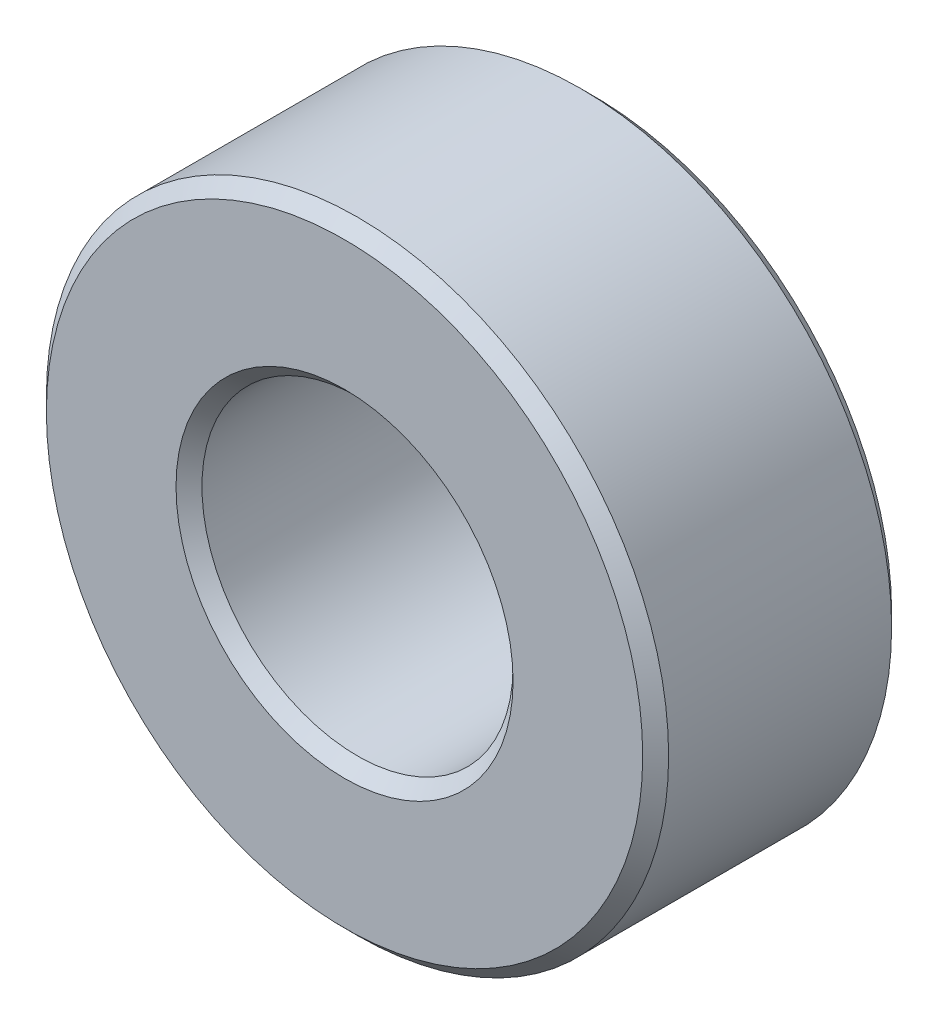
from build123d import *

# Parameters (mm, degrees)
ESQUISSE1_R      = 12
ESQUISSE1_R_2    = 6
EXTRUSION1_DEPTH = 4.8
CHANFREIN1_SIZE  = 0.5


with BuildPart() as part:
    # Esquisse1 → Extrusion1 (new, symmetric)
    with BuildSketch(Plane.XY):
        Circle(ESQUISSE1_R)
        Circle(ESQUISSE1_R_2, mode=Mode.SUBTRACT)
    extrude(amount=EXTRUSION1_DEPTH, both=True)

    # Chanfrein1
    chanfrein1_edges = [part.edges().sort_by_distance(p)[0] for p in [
        (-12, 0, -4.8),
        (-12, 0, 4.8),
        (-6, 0, -4.8),
        (-6, 0, 4.8),
    ]]
    chamfer(chanfrein1_edges, length=CHANFREIN1_SIZE)


solid = part.part
